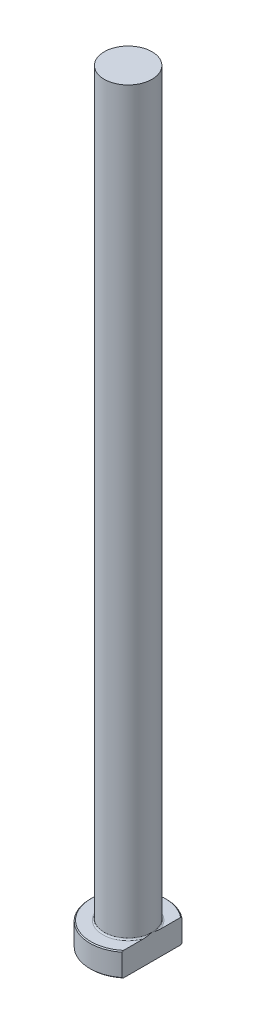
from build123d import *
from build123d.topology import SkipClean

# Parameters (mm, degrees)
CHAMFER1_SIZE = 0.2
FILLET1_R     = 0.3
KEY_DEPTH     = 161.399501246


with BuildPart() as part:
    # Sketch1 → Revolve1 (revolve)
    with BuildSketch(Plane.XY, mode=Mode.PRIVATE) as revolve1_sk:
        Polygon((0, 0), (-8, 0), (-8, 5), (-5, 5), (-5, 160), (0, 160), align=None)
    revolve(revolve1_sk.sketch.rotate(Axis((0, 259.958771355, 0), (0, -1, 0)), 270), axis=Axis((0, 259.958771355, 0), (0, -1, 0)))

    # Chamfer1
    chamfer1_edges = [part.edges().sort_by_distance(p)[0] for p in [
        (0, 5, -8),
        (0, 0, -8),
    ]]
    chamfer(chamfer1_edges, length=CHAMFER1_SIZE)

    # Fillet1
    fillet1_edges = [part.edges().sort_by_distance(p)[0] for p in [
        (0, 5, -5),
    ]]
    fillet(fillet1_edges, radius=FILLET1_R)

    # Sketch2 → KEY (cut, through all)
    with SkipClean():  # the faces are left unmerged after this step: merging them gives an invalid solid
        with BuildSketch(Plane(origin=(0, 0, 0), x_dir=(1, 0, 0), z_dir=(0, 1, 0))):
            with BuildLine():
                Line((5, 6.244997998), (5, -6.244997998))
                ThreePointArc((5, -6.244997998), (8, 0), (5, 6.244997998))
            make_face()
        extrude(amount=KEY_DEPTH, mode=Mode.SUBTRACT)


solid = part.part
